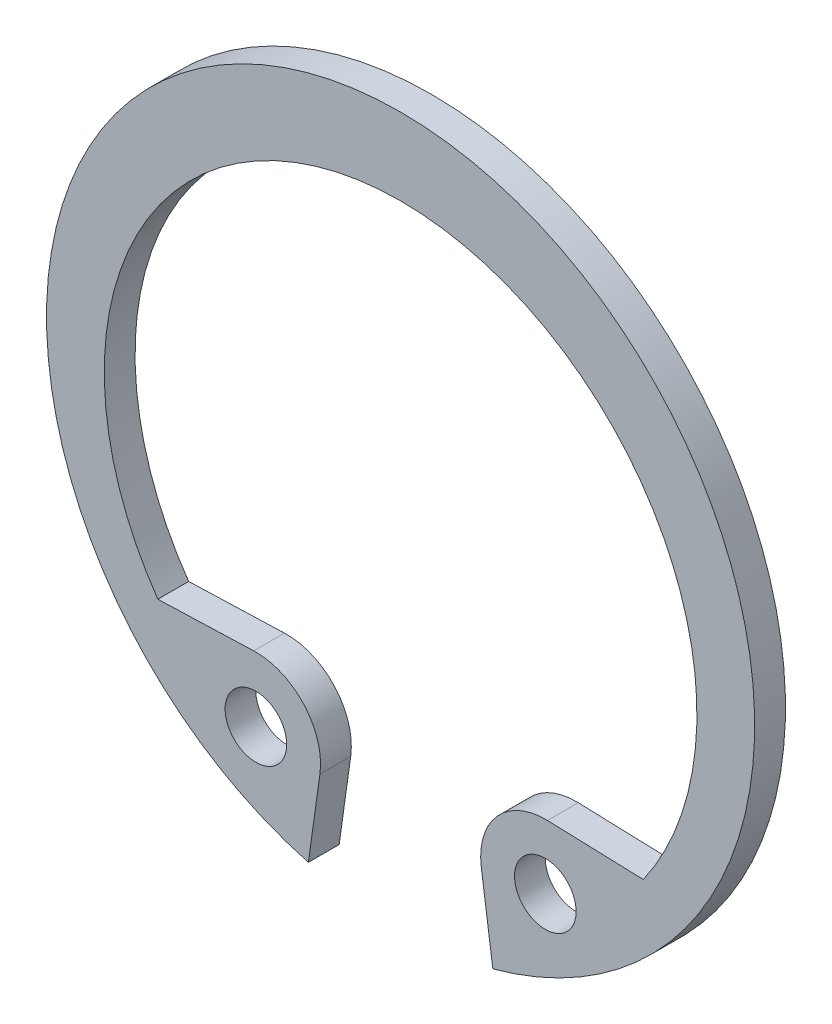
ISO-10303-21;
HEADER;
FILE_DESCRIPTION(('STEP AP214'),'2;1');
FILE_NAME('part.step','',(''),(''),'','','');
FILE_SCHEMA(('AUTOMOTIVE_DESIGN { 1 0 10303 214 1 1 1 1 }'));
ENDSEC;
DATA;
#1=APPLICATION_CONTEXT('core data for automotive mechanical design processes');
#2=APPLICATION_PROTOCOL_DEFINITION('international standard','automotive_design',2000,#1);
#3=PRODUCT_CONTEXT('',#1,'mechanical');
#4=PRODUCT('Part','Part','',(#3));
#5=PRODUCT_RELATED_PRODUCT_CATEGORY('part','',(#4));
#6=PRODUCT_DEFINITION_FORMATION('','',#4);
#7=PRODUCT_DEFINITION_CONTEXT('part definition',#1,'design');
#8=PRODUCT_DEFINITION('design','',#6,#7);
#9=PRODUCT_DEFINITION_SHAPE('','',#8);
#10=(LENGTH_UNIT() NAMED_UNIT(*) SI_UNIT(.MILLI.,.METRE.));
#11=(NAMED_UNIT(*) PLANE_ANGLE_UNIT() SI_UNIT($,.RADIAN.));
#12=(NAMED_UNIT(*) SI_UNIT($,.STERADIAN.) SOLID_ANGLE_UNIT());
#13=UNCERTAINTY_MEASURE_WITH_UNIT(LENGTH_MEASURE(1.E-05),#10,'distance_accuracy_value','');
#14=(GEOMETRIC_REPRESENTATION_CONTEXT(3) GLOBAL_UNCERTAINTY_ASSIGNED_CONTEXT((#13)) GLOBAL_UNIT_ASSIGNED_CONTEXT((#10,
#11,#12)) REPRESENTATION_CONTEXT('',''));
#15=CARTESIAN_POINT('',(0.,0.,0.));
#16=DIRECTION('',(0.,0.,1.));
#17=DIRECTION('',(1.,0.,0.));
#18=AXIS2_PLACEMENT_3D('',#15,#16,#17);
#19=CARTESIAN_POINT('',(-4.76999893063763,-6.04180575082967,1.));
#20=DIRECTION('',(0.0333328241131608,-0.999444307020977,0.));
#21=DIRECTION('',(0.999444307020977,0.0333328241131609,0.));
#22=AXIS2_PLACEMENT_3D('',#19,#20,#21);
#23=PLANE('',#22);
#24=DIRECTION('',(-0.999444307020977,-0.0333328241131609,0.));
#25=VECTOR('',#24,1.);
#26=CARTESIAN_POINT('',(-4.76999893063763,-6.04180575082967,0.));
#27=LINE('',#26,#25);
#28=CARTESIAN_POINT('',(-4.76999893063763,-6.04180575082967,0.));
#29=VERTEX_POINT('',#28);
#30=CARTESIAN_POINT('',(-7.88433842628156,-6.14567319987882,0.));
#31=VERTEX_POINT('',#30);
#32=EDGE_CURVE('E97',#29,#31,#27,.T.);
#33=ORIENTED_EDGE('',*,*,#32,.T.);
#34=DIRECTION('',(0.,0.,-1.));
#35=VECTOR('',#34,1.);
#36=CARTESIAN_POINT('',(-7.88433842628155,-6.14567319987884,1.));
#37=LINE('',#36,#35);
#38=CARTESIAN_POINT('',(-7.88433842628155,-6.14567319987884,1.));
#39=VERTEX_POINT('',#38);
#40=EDGE_CURVE('E10',#39,#31,#37,.T.);
#41=ORIENTED_EDGE('',*,*,#40,.F.);
#42=DIRECTION('',(-0.999444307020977,-0.0333328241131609,0.));
#43=VECTOR('',#42,1.);
#44=CARTESIAN_POINT('',(-4.76999893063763,-6.04180575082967,1.));
#45=LINE('',#44,#43);
#46=CARTESIAN_POINT('',(-4.76999893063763,-6.04180575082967,1.));
#47=VERTEX_POINT('',#46);
#48=EDGE_CURVE('E117',#47,#39,#45,.T.);
#49=ORIENTED_EDGE('',*,*,#48,.F.);
#50=DIRECTION('',(0.,0.,-1.));
#51=VECTOR('',#50,1.);
#52=CARTESIAN_POINT('',(-4.76999893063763,-6.04180575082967,1.));
#53=LINE('',#52,#51);
#54=EDGE_CURVE('E132',#47,#29,#53,.T.);
#55=ORIENTED_EDGE('',*,*,#54,.T.);
#56=EDGE_LOOP('',(#33,#41,#49,#55));
#57=FACE_BOUND('',#56,.T.);
#58=ADVANCED_FACE('F16',(#57),#23,.F.);
#59=CARTESIAN_POINT('',(0.,-0.625000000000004,1.));
#60=DIRECTION('',(0.,0.,-1.));
#61=DIRECTION('',(-1.,0.,0.));
#62=AXIS2_PLACEMENT_3D('',#59,#60,#61);
#63=CYLINDRICAL_SURFACE('',#62,9.625);
#64=CARTESIAN_POINT('',(0.,-0.625000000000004,0.));
#65=DIRECTION('',(0.,0.,1.));
#66=DIRECTION('',(0.,1.,0.));
#67=AXIS2_PLACEMENT_3D('',#64,#65,#66);
#68=CIRCLE('',#67,9.625);
#69=CARTESIAN_POINT('',(7.88433842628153,-6.14567319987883,0.));
#70=VERTEX_POINT('',#69);
#71=EDGE_CURVE('E91',#70,#31,#68,.T.);
#72=ORIENTED_EDGE('',*,*,#71,.F.);
#73=DIRECTION('',(0.,0.,-1.));
#74=VECTOR('',#73,1.);
#75=CARTESIAN_POINT('',(7.88433842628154,-6.14567319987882,1.));
#76=LINE('',#75,#74);
#77=CARTESIAN_POINT('',(7.88433842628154,-6.14567319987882,1.));
#78=VERTEX_POINT('',#77);
#79=EDGE_CURVE('E19',#78,#70,#76,.T.);
#80=ORIENTED_EDGE('',*,*,#79,.F.);
#81=CARTESIAN_POINT('',(0.,-0.625000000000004,1.));
#82=DIRECTION('',(0.,0.,1.));
#83=DIRECTION('',(0.,1.,0.));
#84=AXIS2_PLACEMENT_3D('',#81,#82,#83);
#85=CIRCLE('',#84,9.625);
#86=EDGE_CURVE('E120',#78,#39,#85,.T.);
#87=ORIENTED_EDGE('',*,*,#86,.T.);
#88=ORIENTED_EDGE('',*,*,#40,.T.);
#89=EDGE_LOOP('',(#72,#80,#87,#88));
#90=FACE_BOUND('',#89,.T.);
#91=ADVANCED_FACE('F92',(#90),#63,.F.);
#92=CARTESIAN_POINT('',(4.76999893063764,-6.04180575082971,1.));
#93=DIRECTION('',(0.0333328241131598,0.999444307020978,0.));
#94=DIRECTION('',(-0.999444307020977,0.0333328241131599,0.));
#95=AXIS2_PLACEMENT_3D('',#92,#93,#94);
#96=PLANE('',#95);
#97=DIRECTION('',(0.999444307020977,-0.0333328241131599,0.));
#98=VECTOR('',#97,1.);
#99=CARTESIAN_POINT('',(4.76999893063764,-6.04180575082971,0.));
#100=LINE('',#99,#98);
#101=CARTESIAN_POINT('',(4.76999893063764,-6.04180575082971,0.));
#102=VERTEX_POINT('',#101);
#103=EDGE_CURVE('E83',#102,#70,#100,.T.);
#104=ORIENTED_EDGE('',*,*,#103,.F.);
#105=DIRECTION('',(0.,0.,-1.));
#106=VECTOR('',#105,1.);
#107=CARTESIAN_POINT('',(4.76999893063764,-6.04180575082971,1.));
#108=LINE('',#107,#106);
#109=CARTESIAN_POINT('',(4.76999893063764,-6.04180575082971,1.));
#110=VERTEX_POINT('',#109);
#111=EDGE_CURVE('E89',#110,#102,#108,.T.);
#112=ORIENTED_EDGE('',*,*,#111,.F.);
#113=DIRECTION('',(0.999444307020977,-0.0333328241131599,0.));
#114=VECTOR('',#113,1.);
#115=CARTESIAN_POINT('',(4.76999893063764,-6.04180575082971,1.));
#116=LINE('',#115,#114);
#117=EDGE_CURVE('E85',#110,#78,#116,.T.);
#118=ORIENTED_EDGE('',*,*,#117,.T.);
#119=ORIENTED_EDGE('',*,*,#79,.T.);
#120=EDGE_LOOP('',(#104,#112,#118,#119));
#121=FACE_BOUND('',#120,.T.);
#122=ADVANCED_FACE('F81',(#121),#96,.T.);
#123=CARTESIAN_POINT('',(4.69999999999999,-8.14063879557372,1.));
#124=DIRECTION('',(0.,0.,-1.));
#125=DIRECTION('',(-1.,0.,0.));
#126=AXIS2_PLACEMENT_3D('',#123,#124,#125);
#127=CYLINDRICAL_SURFACE('',#126,2.1);
#128=CARTESIAN_POINT('',(4.69999999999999,-8.14063879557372,0.));
#129=DIRECTION('',(0.,0.,1.));
#130=DIRECTION('',(0.,1.,0.));
#131=AXIS2_PLACEMENT_3D('',#128,#129,#130);
#132=CIRCLE('',#131,2.1);
#133=CARTESIAN_POINT('',(2.62043705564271,-8.4329023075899,0.));
#134=VERTEX_POINT('',#133);
#135=EDGE_CURVE('E102',#102,#134,#132,.T.);
#136=ORIENTED_EDGE('',*,*,#135,.T.);
#137=DIRECTION('',(0.,0.,-1.));
#138=VECTOR('',#137,1.);
#139=CARTESIAN_POINT('',(2.62043705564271,-8.43290230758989,1.));
#140=LINE('',#139,#138);
#141=CARTESIAN_POINT('',(2.62043705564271,-8.43290230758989,1.));
#142=VERTEX_POINT('',#141);
#143=EDGE_CURVE('E142',#142,#134,#140,.T.);
#144=ORIENTED_EDGE('',*,*,#143,.F.);
#145=CARTESIAN_POINT('',(4.69999999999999,-8.14063879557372,1.));
#146=DIRECTION('',(0.,0.,1.));
#147=DIRECTION('',(0.,1.,0.));
#148=AXIS2_PLACEMENT_3D('',#145,#146,#147);
#149=CIRCLE('',#148,2.1);
#150=EDGE_CURVE('E123',#110,#142,#149,.T.);
#151=ORIENTED_EDGE('',*,*,#150,.F.);
#152=ORIENTED_EDGE('',*,*,#111,.T.);
#153=EDGE_LOOP('',(#136,#144,#151,#152));
#154=FACE_BOUND('',#153,.T.);
#155=ADVANCED_FACE('F147',(#154),#127,.T.);
#156=CARTESIAN_POINT('',(2.62043705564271,-8.43290230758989,1.));
#157=DIRECTION('',(0.990268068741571,0.139173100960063,0.));
#158=DIRECTION('',(-0.139173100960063,0.990268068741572,0.));
#159=AXIS2_PLACEMENT_3D('',#156,#157,#158);
#160=PLANE('',#159);
#161=DIRECTION('',(0.139173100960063,-0.990268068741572,0.));
#162=VECTOR('',#161,1.);
#163=CARTESIAN_POINT('',(2.62043705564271,-8.4329023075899,0.));
#164=LINE('',#163,#162);
#165=CARTESIAN_POINT('',(2.99568995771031,-11.1029654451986,0.));
#166=VERTEX_POINT('',#165);
#167=EDGE_CURVE('E104',#134,#166,#164,.T.);
#168=ORIENTED_EDGE('',*,*,#167,.T.);
#169=DIRECTION('',(0.,0.,-1.));
#170=VECTOR('',#169,1.);
#171=CARTESIAN_POINT('',(2.99568995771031,-11.1029654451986,1.00000000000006));
#172=LINE('',#171,#170);
#173=CARTESIAN_POINT('',(2.99568995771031,-11.1029654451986,1.00000000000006));
#174=VERTEX_POINT('',#173);
#175=EDGE_CURVE('E139',#174,#166,#172,.T.);
#176=ORIENTED_EDGE('',*,*,#175,.F.);
#177=DIRECTION('',(0.139173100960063,-0.990268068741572,0.));
#178=VECTOR('',#177,1.);
#179=CARTESIAN_POINT('',(2.62043705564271,-8.43290230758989,1.));
#180=LINE('',#179,#178);
#181=EDGE_CURVE('E125',#142,#174,#180,.T.);
#182=ORIENTED_EDGE('',*,*,#181,.F.);
#183=ORIENTED_EDGE('',*,*,#143,.T.);
#184=EDGE_LOOP('',(#168,#176,#182,#183));
#185=FACE_BOUND('',#184,.T.);
#186=ADVANCED_FACE('F163',(#185),#160,.F.);
#187=CARTESIAN_POINT('',(0.,0.,1.));
#188=DIRECTION('',(0.,0.,-1.));
#189=DIRECTION('',(-1.,0.,0.));
#190=AXIS2_PLACEMENT_3D('',#187,#188,#189);
#191=CYLINDRICAL_SURFACE('',#190,11.5);
#192=CARTESIAN_POINT('',(0.,0.,0.));
#193=DIRECTION('',(0.,0.,1.));
#194=DIRECTION('',(0.,1.,0.));
#195=AXIS2_PLACEMENT_3D('',#192,#193,#194);
#196=CIRCLE('',#195,11.5);
#197=CARTESIAN_POINT('',(-2.99568995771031,-11.1029654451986,0.));
#198=VERTEX_POINT('',#197);
#199=EDGE_CURVE('E109',#166,#198,#196,.T.);
#200=ORIENTED_EDGE('',*,*,#199,.T.);
#201=DIRECTION('',(0.,0.,-1.));
#202=VECTOR('',#201,1.);
#203=CARTESIAN_POINT('',(-2.99568995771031,-11.1029654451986,1.));
#204=LINE('',#203,#202);
#205=CARTESIAN_POINT('',(-2.99568995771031,-11.1029654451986,1.));
#206=VERTEX_POINT('',#205);
#207=EDGE_CURVE('E137',#206,#198,#204,.T.);
#208=ORIENTED_EDGE('',*,*,#207,.F.);
#209=CARTESIAN_POINT('',(0.,0.,1.));
#210=DIRECTION('',(0.,0.,1.));
#211=DIRECTION('',(0.,1.,0.));
#212=AXIS2_PLACEMENT_3D('',#209,#210,#211);
#213=CIRCLE('',#212,11.5);
#214=EDGE_CURVE('E127',#174,#206,#213,.T.);
#215=ORIENTED_EDGE('',*,*,#214,.F.);
#216=ORIENTED_EDGE('',*,*,#175,.T.);
#217=EDGE_LOOP('',(#200,#208,#215,#216));
#218=FACE_BOUND('',#217,.T.);
#219=ADVANCED_FACE('F160',(#218),#191,.T.);
#220=CARTESIAN_POINT('',(-2.6204370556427,-8.43290230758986,1.));
#221=DIRECTION('',(0.99026806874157,-0.139173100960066,0.));
#222=DIRECTION('',(0.139173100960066,0.990268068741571,0.));
#223=AXIS2_PLACEMENT_3D('',#220,#221,#222);
#224=PLANE('',#223);
#225=DIRECTION('',(-0.139173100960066,-0.990268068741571,0.));
#226=VECTOR('',#225,1.);
#227=CARTESIAN_POINT('',(-2.6204370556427,-8.43290230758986,0.));
#228=LINE('',#227,#226);
#229=CARTESIAN_POINT('',(-2.6204370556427,-8.43290230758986,0.));
#230=VERTEX_POINT('',#229);
#231=EDGE_CURVE('E112',#230,#198,#228,.T.);
#232=ORIENTED_EDGE('',*,*,#231,.F.);
#233=DIRECTION('',(0.,0.,-1.));
#234=VECTOR('',#233,1.);
#235=CARTESIAN_POINT('',(-2.6204370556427,-8.43290230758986,1.));
#236=LINE('',#235,#234);
#237=CARTESIAN_POINT('',(-2.6204370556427,-8.43290230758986,1.));
#238=VERTEX_POINT('',#237);
#239=EDGE_CURVE('E38',#238,#230,#236,.T.);
#240=ORIENTED_EDGE('',*,*,#239,.F.);
#241=DIRECTION('',(-0.139173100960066,-0.990268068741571,0.));
#242=VECTOR('',#241,1.);
#243=CARTESIAN_POINT('',(-2.6204370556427,-8.43290230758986,1.));
#244=LINE('',#243,#242);
#245=EDGE_CURVE('E129',#238,#206,#244,.T.);
#246=ORIENTED_EDGE('',*,*,#245,.T.);
#247=ORIENTED_EDGE('',*,*,#207,.T.);
#248=EDGE_LOOP('',(#232,#240,#246,#247));
#249=FACE_BOUND('',#248,.T.);
#250=ADVANCED_FACE('F156',(#249),#224,.T.);
#251=CARTESIAN_POINT('',(-4.70000000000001,-8.14063879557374,1.));
#252=DIRECTION('',(0.,0.,-1.));
#253=DIRECTION('',(-1.,0.,0.));
#254=AXIS2_PLACEMENT_3D('',#251,#252,#253);
#255=CYLINDRICAL_SURFACE('',#254,2.1);
#256=CARTESIAN_POINT('',(-4.70000000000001,-8.14063879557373,0.));
#257=DIRECTION('',(0.,0.,1.));
#258=DIRECTION('',(0.,1.,0.));
#259=AXIS2_PLACEMENT_3D('',#256,#257,#258);
#260=CIRCLE('',#259,2.1);
#261=EDGE_CURVE('E115',#230,#29,#260,.T.);
#262=ORIENTED_EDGE('',*,*,#261,.T.);
#263=ORIENTED_EDGE('',*,*,#54,.F.);
#264=CARTESIAN_POINT('',(-4.70000000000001,-8.14063879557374,1.));
#265=DIRECTION('',(0.,0.,1.));
#266=DIRECTION('',(0.,1.,0.));
#267=AXIS2_PLACEMENT_3D('',#264,#265,#266);
#268=CIRCLE('',#267,2.1);
#269=EDGE_CURVE('E30',#238,#47,#268,.T.);
#270=ORIENTED_EDGE('',*,*,#269,.F.);
#271=ORIENTED_EDGE('',*,*,#239,.T.);
#272=EDGE_LOOP('',(#262,#263,#270,#271));
#273=FACE_BOUND('',#272,.T.);
#274=ADVANCED_FACE('F170',(#273),#255,.T.);
#275=CARTESIAN_POINT('',(0.,-0.625000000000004,1.));
#276=DIRECTION('',(0.,0.,1.));
#277=DIRECTION('',(1.,0.,0.));
#278=AXIS2_PLACEMENT_3D('',#275,#276,#277);
#279=PLANE('',#278);
#280=CARTESIAN_POINT('',(4.69999999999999,-8.14063879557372,1.));
#281=DIRECTION('',(0.,0.,-1.));
#282=DIRECTION('',(0.,1.,0.));
#283=AXIS2_PLACEMENT_3D('',#280,#281,#282);
#284=CIRCLE('',#283,1.);
#285=CARTESIAN_POINT('',(4.69999999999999,-7.14063879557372,1.));
#286=VERTEX_POINT('',#285);
#287=EDGE_CURVE('E184',#286,#286,#284,.T.);
#288=ORIENTED_EDGE('',*,*,#287,.T.);
#289=EDGE_LOOP('',(#288));
#290=FACE_BOUND('',#289,.T.);
#291=CARTESIAN_POINT('',(-4.70000000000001,-8.14063879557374,1.));
#292=DIRECTION('',(0.,0.,-1.));
#293=DIRECTION('',(0.,1.,0.));
#294=AXIS2_PLACEMENT_3D('',#291,#292,#293);
#295=CIRCLE('',#294,1.);
#296=CARTESIAN_POINT('',(-4.70000000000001,-7.14063879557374,1.));
#297=VERTEX_POINT('',#296);
#298=EDGE_CURVE('E119',#297,#297,#295,.T.);
#299=ORIENTED_EDGE('',*,*,#298,.T.);
#300=EDGE_LOOP('',(#299));
#301=FACE_BOUND('',#300,.T.);
#302=ORIENTED_EDGE('',*,*,#48,.T.);
#303=ORIENTED_EDGE('',*,*,#86,.F.);
#304=ORIENTED_EDGE('',*,*,#117,.F.);
#305=ORIENTED_EDGE('',*,*,#150,.T.);
#306=ORIENTED_EDGE('',*,*,#181,.T.);
#307=ORIENTED_EDGE('',*,*,#214,.T.);
#308=ORIENTED_EDGE('',*,*,#245,.F.);
#309=ORIENTED_EDGE('',*,*,#269,.T.);
#310=EDGE_LOOP('',(#302,#303,#304,#305,#306,#307,#308,#309));
#311=FACE_BOUND('',#310,.T.);
#312=ADVANCED_FACE('F150',(#290,#301,#311),#279,.T.);
#313=CARTESIAN_POINT('',(0.,-0.625000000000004,0.));
#314=DIRECTION('',(0.,0.,1.));
#315=DIRECTION('',(1.,0.,0.));
#316=AXIS2_PLACEMENT_3D('',#313,#314,#315);
#317=PLANE('',#316);
#318=CARTESIAN_POINT('',(4.69999999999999,-8.14063879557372,0.));
#319=DIRECTION('',(0.,0.,1.));
#320=DIRECTION('',(0.,1.,0.));
#321=AXIS2_PLACEMENT_3D('',#318,#319,#320);
#322=CIRCLE('',#321,1.);
#323=CARTESIAN_POINT('',(4.69999999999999,-7.14063879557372,0.));
#324=VERTEX_POINT('',#323);
#325=EDGE_CURVE('E187',#324,#324,#322,.T.);
#326=ORIENTED_EDGE('',*,*,#325,.T.);
#327=EDGE_LOOP('',(#326));
#328=FACE_BOUND('',#327,.T.);
#329=CARTESIAN_POINT('',(-4.70000000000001,-8.14063879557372,0.));
#330=DIRECTION('',(0.,0.,1.));
#331=DIRECTION('',(0.,1.,0.));
#332=AXIS2_PLACEMENT_3D('',#329,#330,#331);
#333=CIRCLE('',#332,1.);
#334=CARTESIAN_POINT('',(-4.70000000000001,-7.14063879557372,0.));
#335=VERTEX_POINT('',#334);
#336=EDGE_CURVE('E189',#335,#335,#333,.T.);
#337=ORIENTED_EDGE('',*,*,#336,.T.);
#338=EDGE_LOOP('',(#337));
#339=FACE_BOUND('',#338,.T.);
#340=ORIENTED_EDGE('',*,*,#32,.F.);
#341=ORIENTED_EDGE('',*,*,#261,.F.);
#342=ORIENTED_EDGE('',*,*,#231,.T.);
#343=ORIENTED_EDGE('',*,*,#199,.F.);
#344=ORIENTED_EDGE('',*,*,#167,.F.);
#345=ORIENTED_EDGE('',*,*,#135,.F.);
#346=ORIENTED_EDGE('',*,*,#103,.T.);
#347=ORIENTED_EDGE('',*,*,#71,.T.);
#348=EDGE_LOOP('',(#340,#341,#342,#343,#344,#345,#346,#347));
#349=FACE_BOUND('',#348,.T.);
#350=ADVANCED_FACE('F100',(#328,#339,#349),#317,.F.);
#351=CARTESIAN_POINT('',(-4.70000000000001,-8.14063879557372,0.));
#352=DIRECTION('',(0.,0.,1.));
#353=DIRECTION('',(0.,1.,0.));
#354=AXIS2_PLACEMENT_3D('',#351,#352,#353);
#355=CYLINDRICAL_SURFACE('',#354,1.);
#356=ORIENTED_EDGE('',*,*,#298,.F.);
#357=EDGE_LOOP('',(#356));
#358=FACE_BOUND('',#357,.T.);
#359=ORIENTED_EDGE('',*,*,#336,.F.);
#360=EDGE_LOOP('',(#359));
#361=FACE_BOUND('',#360,.T.);
#362=ADVANCED_FACE('F175',(#358,#361),#355,.F.);
#363=CARTESIAN_POINT('',(4.69999999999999,-8.14063879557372,0.));
#364=DIRECTION('',(0.,0.,1.));
#365=DIRECTION('',(0.,1.,0.));
#366=AXIS2_PLACEMENT_3D('',#363,#364,#365);
#367=CYLINDRICAL_SURFACE('',#366,1.);
#368=ORIENTED_EDGE('',*,*,#287,.F.);
#369=EDGE_LOOP('',(#368));
#370=FACE_BOUND('',#369,.T.);
#371=ORIENTED_EDGE('',*,*,#325,.F.);
#372=EDGE_LOOP('',(#371));
#373=FACE_BOUND('',#372,.T.);
#374=ADVANCED_FACE('F178',(#370,#373),#367,.F.);
#375=CLOSED_SHELL('',(#58,#91,#122,#155,#186,#219,#250,#274,#312,#350,#362,#374));
#376=MANIFOLD_SOLID_BREP('B1',#375);
#377=ADVANCED_BREP_SHAPE_REPRESENTATION('',(#18,#376),#14);
#378=SHAPE_DEFINITION_REPRESENTATION(#9,#377);
ENDSEC;
END-ISO-10303-21;
